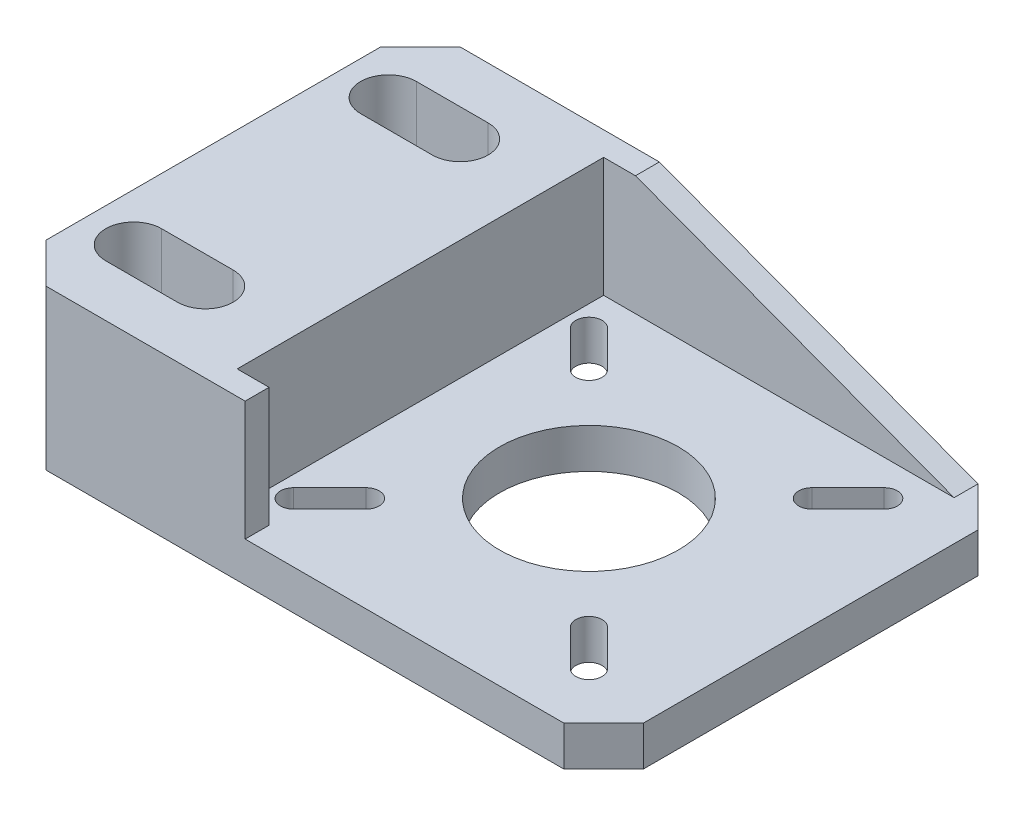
ISO-10303-21;
HEADER;
FILE_DESCRIPTION(('STEP AP214'),'2;1');
FILE_NAME('part.step','',(''),(''),'','','');
FILE_SCHEMA(('AUTOMOTIVE_DESIGN { 1 0 10303 214 1 1 1 1 }'));
ENDSEC;
DATA;
#1=APPLICATION_CONTEXT('core data for automotive mechanical design processes');
#2=APPLICATION_PROTOCOL_DEFINITION('international standard','automotive_design',2000,#1);
#3=PRODUCT_CONTEXT('',#1,'mechanical');
#4=PRODUCT('Part','Part','',(#3));
#5=PRODUCT_RELATED_PRODUCT_CATEGORY('part','',(#4));
#6=PRODUCT_DEFINITION_FORMATION('','',#4);
#7=PRODUCT_DEFINITION_CONTEXT('part definition',#1,'design');
#8=PRODUCT_DEFINITION('design','',#6,#7);
#9=PRODUCT_DEFINITION_SHAPE('','',#8);
#10=(LENGTH_UNIT() NAMED_UNIT(*) SI_UNIT(.MILLI.,.METRE.));
#11=(NAMED_UNIT(*) PLANE_ANGLE_UNIT() SI_UNIT($,.RADIAN.));
#12=(NAMED_UNIT(*) SI_UNIT($,.STERADIAN.) SOLID_ANGLE_UNIT());
#13=UNCERTAINTY_MEASURE_WITH_UNIT(LENGTH_MEASURE(1.E-05),#10,'distance_accuracy_value','');
#14=(GEOMETRIC_REPRESENTATION_CONTEXT(3) GLOBAL_UNCERTAINTY_ASSIGNED_CONTEXT((#13)) GLOBAL_UNIT_ASSIGNED_CONTEXT((#10,
#11,#12)) REPRESENTATION_CONTEXT('',''));
#15=CARTESIAN_POINT('',(0.,0.,0.));
#16=DIRECTION('',(0.,0.,1.));
#17=DIRECTION('',(1.,0.,0.));
#18=AXIS2_PLACEMENT_3D('',#15,#16,#17);
#19=CARTESIAN_POINT('',(502.609898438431,-41.1735855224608,95.0226086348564));
#20=DIRECTION('',(0.,0.,1.));
#21=DIRECTION('',(1.,0.,0.));
#22=AXIS2_PLACEMENT_3D('',#19,#20,#21);
#23=PLANE('',#22);
#24=DIRECTION('',(1.,0.,0.));
#25=VECTOR('',#24,1.);
#26=CARTESIAN_POINT('',(0.,20.,95.0226086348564));
#27=LINE('',#26,#25);
#28=CARTESIAN_POINT('',(502.609898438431,20.,95.0226086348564));
#29=VERTEX_POINT('',#28);
#30=CARTESIAN_POINT('',(498.609898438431,20.,95.0226086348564));
#31=VERTEX_POINT('',#30);
#32=EDGE_CURVE('E435',#29,#31,#27,.F.);
#33=ORIENTED_EDGE('',*,*,#32,.F.);
#34=DIRECTION('',(0.,1.,0.));
#35=VECTOR('',#34,1.);
#36=CARTESIAN_POINT('',(502.609898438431,20.,95.0226086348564));
#37=LINE('',#36,#35);
#38=CARTESIAN_POINT('',(502.609898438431,5.,95.0226086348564));
#39=VERTEX_POINT('',#38);
#40=EDGE_CURVE('E444',#29,#39,#37,.F.);
#41=ORIENTED_EDGE('',*,*,#40,.T.);
#42=DIRECTION('',(1.,0.,0.));
#43=VECTOR('',#42,1.);
#44=CARTESIAN_POINT('',(0.,5.,95.0226086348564));
#45=LINE('',#44,#43);
#46=CARTESIAN_POINT('',(498.609898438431,5.,95.0226086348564));
#47=VERTEX_POINT('',#46);
#48=EDGE_CURVE('E406',#39,#47,#45,.F.);
#49=ORIENTED_EDGE('',*,*,#48,.T.);
#50=DIRECTION('',(0.,1.,0.));
#51=VECTOR('',#50,1.);
#52=CARTESIAN_POINT('',(498.609898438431,-41.1735855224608,95.0226086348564));
#53=LINE('',#52,#51);
#54=EDGE_CURVE('E455',#47,#31,#53,.T.);
#55=ORIENTED_EDGE('',*,*,#54,.T.);
#56=EDGE_LOOP('',(#33,#41,#49,#55));
#57=FACE_BOUND('',#56,.T.);
#58=ADVANCED_FACE('F17',(#57),#23,.F.);
#59=CARTESIAN_POINT('',(498.609898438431,-41.1735855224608,49.0226086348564));
#60=DIRECTION('',(-1.,0.,0.));
#61=DIRECTION('',(0.,0.,1.));
#62=AXIS2_PLACEMENT_3D('',#59,#60,#61);
#63=PLANE('',#62);
#64=DIRECTION('',(0.,0.,1.));
#65=VECTOR('',#64,1.);
#66=CARTESIAN_POINT('',(498.609898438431,20.,0.));
#67=LINE('',#66,#65);
#68=CARTESIAN_POINT('',(498.609898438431,20.,49.0226086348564));
#69=VERTEX_POINT('',#68);
#70=EDGE_CURVE('E432',#31,#69,#67,.F.);
#71=ORIENTED_EDGE('',*,*,#70,.F.);
#72=ORIENTED_EDGE('',*,*,#54,.F.);
#73=DIRECTION('',(0.,0.,-1.));
#74=VECTOR('',#73,1.);
#75=CARTESIAN_POINT('',(498.609898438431,5.,0.));
#76=LINE('',#75,#74);
#77=CARTESIAN_POINT('',(498.609898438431,5.,49.0226086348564));
#78=VERTEX_POINT('',#77);
#79=EDGE_CURVE('E403',#47,#78,#76,.T.);
#80=ORIENTED_EDGE('',*,*,#79,.T.);
#81=DIRECTION('',(0.,1.,0.));
#82=VECTOR('',#81,1.);
#83=CARTESIAN_POINT('',(498.609898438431,0.,49.0226086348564));
#84=LINE('',#83,#82);
#85=EDGE_CURVE('E447',#78,#69,#84,.T.);
#86=ORIENTED_EDGE('',*,*,#85,.T.);
#87=EDGE_LOOP('',(#71,#72,#80,#86));
#88=FACE_BOUND('',#87,.T.);
#89=ADVANCED_FACE('F664',(#88),#63,.F.);
#90=CARTESIAN_POINT('',(0.,0.,49.0226086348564));
#91=DIRECTION('',(0.,0.,-1.));
#92=DIRECTION('',(-1.,0.,0.));
#93=AXIS2_PLACEMENT_3D('',#90,#91,#92);
#94=PLANE('',#93);
#95=DIRECTION('',(-0.936329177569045,0.351123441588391,0.));
#96=VECTOR('',#95,1.);
#97=CARTESIAN_POINT('',(542.609898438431,5.,49.0226086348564));
#98=LINE('',#97,#96);
#99=CARTESIAN_POINT('',(502.609898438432,20.,49.0226086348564));
#100=VERTEX_POINT('',#99);
#101=CARTESIAN_POINT('',(542.609898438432,4.99999999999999,49.0226086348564));
#102=VERTEX_POINT('',#101);
#103=EDGE_CURVE('E415',#100,#102,#98,.F.);
#104=ORIENTED_EDGE('',*,*,#103,.F.);
#105=DIRECTION('',(1.,0.,0.));
#106=VECTOR('',#105,1.);
#107=CARTESIAN_POINT('',(0.,20.,49.0226086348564));
#108=LINE('',#107,#106);
#109=EDGE_CURVE('E441',#69,#100,#108,.T.);
#110=ORIENTED_EDGE('',*,*,#109,.F.);
#111=ORIENTED_EDGE('',*,*,#85,.F.);
#112=DIRECTION('',(1.,0.,0.));
#113=VECTOR('',#112,1.);
#114=CARTESIAN_POINT('',(0.,5.,49.0226086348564));
#115=LINE('',#114,#113);
#116=EDGE_CURVE('E399',#78,#102,#115,.T.);
#117=ORIENTED_EDGE('',*,*,#116,.T.);
#118=EDGE_LOOP('',(#104,#110,#111,#117));
#119=FACE_BOUND('',#118,.T.);
#120=ADVANCED_FACE('F661',(#119),#94,.F.);
#121=CARTESIAN_POINT('',(502.609898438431,20.,46.0226086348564));
#122=DIRECTION('',(-1.,0.,0.));
#123=DIRECTION('',(0.,0.,1.));
#124=AXIS2_PLACEMENT_3D('',#121,#122,#123);
#125=PLANE('',#124);
#126=ORIENTED_EDGE('',*,*,#40,.F.);
#127=DIRECTION('',(0.,0.,1.));
#128=VECTOR('',#127,1.);
#129=CARTESIAN_POINT('',(502.609898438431,20.,0.));
#130=LINE('',#129,#128);
#131=CARTESIAN_POINT('',(502.609898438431,20.,98.0226086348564));
#132=VERTEX_POINT('',#131);
#133=EDGE_CURVE('E438',#132,#29,#130,.F.);
#134=ORIENTED_EDGE('',*,*,#133,.F.);
#135=DIRECTION('',(0.,1.,0.));
#136=VECTOR('',#135,1.);
#137=CARTESIAN_POINT('',(502.609898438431,5.,98.0226086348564));
#138=LINE('',#137,#136);
#139=CARTESIAN_POINT('',(502.609898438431,5.,98.0226086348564));
#140=VERTEX_POINT('',#139);
#141=EDGE_CURVE('E372',#132,#140,#138,.F.);
#142=ORIENTED_EDGE('',*,*,#141,.T.);
#143=DIRECTION('',(0.,0.,-1.));
#144=VECTOR('',#143,1.);
#145=CARTESIAN_POINT('',(502.609898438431,5.,0.));
#146=LINE('',#145,#144);
#147=EDGE_CURVE('E409',#140,#39,#146,.T.);
#148=ORIENTED_EDGE('',*,*,#147,.T.);
#149=EDGE_LOOP('',(#126,#134,#142,#148));
#150=FACE_BOUND('',#149,.T.);
#151=ADVANCED_FACE('F657',(#150),#125,.F.);
#152=CARTESIAN_POINT('',(0.,20.,0.));
#153=DIRECTION('',(0.,1.,0.));
#154=DIRECTION('',(0.,0.,1.));
#155=AXIS2_PLACEMENT_3D('',#152,#153,#154);
#156=PLANE('',#155);
#157=DIRECTION('',(1.,0.,0.));
#158=VECTOR('',#157,1.);
#159=CARTESIAN_POINT('',(487.609898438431,20.,59.5226086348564));
#160=LINE('',#159,#158);
#161=CARTESIAN_POINT('',(487.609898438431,20.,59.5226086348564));
#162=VERTEX_POINT('',#161);
#163=CARTESIAN_POINT('',(478.609898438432,20.,59.5226086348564));
#164=VERTEX_POINT('',#163);
#165=EDGE_CURVE('E383',#162,#164,#160,.F.);
#166=ORIENTED_EDGE('',*,*,#165,.T.);
#167=CARTESIAN_POINT('',(478.609898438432,20.,56.0226086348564));
#168=DIRECTION('',(0.,-1.,0.));
#169=DIRECTION('',(0.,0.,-1.));
#170=AXIS2_PLACEMENT_3D('',#167,#168,#169);
#171=CIRCLE('',#170,3.50000000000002);
#172=CARTESIAN_POINT('',(478.609898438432,20.,52.5226086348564));
#173=VERTEX_POINT('',#172);
#174=EDGE_CURVE('E386',#164,#173,#171,.T.);
#175=ORIENTED_EDGE('',*,*,#174,.T.);
#176=DIRECTION('',(-1.,0.,0.));
#177=VECTOR('',#176,1.);
#178=CARTESIAN_POINT('',(487.609898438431,20.,52.5226086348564));
#179=LINE('',#178,#177);
#180=CARTESIAN_POINT('',(487.609898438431,20.,52.5226086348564));
#181=VERTEX_POINT('',#180);
#182=EDGE_CURVE('E448',#173,#181,#179,.F.);
#183=ORIENTED_EDGE('',*,*,#182,.T.);
#184=CARTESIAN_POINT('',(487.609898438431,20.,56.0226086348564));
#185=DIRECTION('',(0.,-1.,0.));
#186=DIRECTION('',(0.,0.,-1.));
#187=AXIS2_PLACEMENT_3D('',#184,#185,#186);
#188=CIRCLE('',#187,3.5);
#189=EDGE_CURVE('E375',#181,#162,#188,.T.);
#190=ORIENTED_EDGE('',*,*,#189,.T.);
#191=EDGE_LOOP('',(#166,#175,#183,#190));
#192=FACE_BOUND('',#191,.T.);
#193=DIRECTION('',(1.,0.,0.));
#194=VECTOR('',#193,1.);
#195=CARTESIAN_POINT('',(487.609898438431,20.,91.5226086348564));
#196=LINE('',#195,#194);
#197=CARTESIAN_POINT('',(487.609898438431,20.,91.5226086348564));
#198=VERTEX_POINT('',#197);
#199=CARTESIAN_POINT('',(478.609898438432,20.,91.5226086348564));
#200=VERTEX_POINT('',#199);
#201=EDGE_CURVE('E395',#198,#200,#196,.F.);
#202=ORIENTED_EDGE('',*,*,#201,.T.);
#203=CARTESIAN_POINT('',(478.609898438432,20.,88.0226086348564));
#204=DIRECTION('',(0.,-1.,0.));
#205=DIRECTION('',(0.,0.,-1.));
#206=AXIS2_PLACEMENT_3D('',#203,#204,#205);
#207=CIRCLE('',#206,3.50000000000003);
#208=CARTESIAN_POINT('',(478.609898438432,20.,84.5226086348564));
#209=VERTEX_POINT('',#208);
#210=EDGE_CURVE('E20',#200,#209,#207,.T.);
#211=ORIENTED_EDGE('',*,*,#210,.T.);
#212=DIRECTION('',(-1.,0.,0.));
#213=VECTOR('',#212,1.);
#214=CARTESIAN_POINT('',(487.609898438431,20.,84.5226086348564));
#215=LINE('',#214,#213);
#216=CARTESIAN_POINT('',(487.609898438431,20.,84.5226086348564));
#217=VERTEX_POINT('',#216);
#218=EDGE_CURVE('E402',#209,#217,#215,.F.);
#219=ORIENTED_EDGE('',*,*,#218,.T.);
#220=CARTESIAN_POINT('',(487.609898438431,20.,88.0226086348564));
#221=DIRECTION('',(0.,-1.,0.));
#222=DIRECTION('',(0.,0.,-1.));
#223=AXIS2_PLACEMENT_3D('',#220,#221,#222);
#224=CIRCLE('',#223,3.5);
#225=EDGE_CURVE('E393',#217,#198,#224,.T.);
#226=ORIENTED_EDGE('',*,*,#225,.T.);
#227=EDGE_LOOP('',(#202,#211,#219,#226));
#228=FACE_BOUND('',#227,.T.);
#229=ORIENTED_EDGE('',*,*,#32,.T.);
#230=ORIENTED_EDGE('',*,*,#70,.T.);
#231=ORIENTED_EDGE('',*,*,#109,.T.);
#232=DIRECTION('',(0.,0.,1.));
#233=VECTOR('',#232,1.);
#234=CARTESIAN_POINT('',(502.609898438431,20.,49.0226086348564));
#235=LINE('',#234,#233);
#236=CARTESIAN_POINT('',(502.609898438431,20.,46.0226086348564));
#237=VERTEX_POINT('',#236);
#238=EDGE_CURVE('E429',#237,#100,#235,.T.);
#239=ORIENTED_EDGE('',*,*,#238,.F.);
#240=DIRECTION('',(1.,0.,0.));
#241=VECTOR('',#240,1.);
#242=CARTESIAN_POINT('',(547.609898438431,20.,46.0226086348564));
#243=LINE('',#242,#241);
#244=CARTESIAN_POINT('',(477.609898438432,20.,46.0226086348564));
#245=VERTEX_POINT('',#244);
#246=EDGE_CURVE('E345',#237,#245,#243,.F.);
#247=ORIENTED_EDGE('',*,*,#246,.T.);
#248=DIRECTION('',(0.707106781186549,0.,-0.707106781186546));
#249=VECTOR('',#248,1.);
#250=CARTESIAN_POINT('',(472.609898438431,20.,51.0226086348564));
#251=LINE('',#250,#249);
#252=CARTESIAN_POINT('',(472.609898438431,20.,51.0226086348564));
#253=VERTEX_POINT('',#252);
#254=EDGE_CURVE('E348',#245,#253,#251,.F.);
#255=ORIENTED_EDGE('',*,*,#254,.T.);
#256=DIRECTION('',(0.,0.,-1.));
#257=VECTOR('',#256,1.);
#258=CARTESIAN_POINT('',(472.609898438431,20.,46.0226086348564));
#259=LINE('',#258,#257);
#260=CARTESIAN_POINT('',(472.609898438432,20.,93.0226086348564));
#261=VERTEX_POINT('',#260);
#262=EDGE_CURVE('E357',#253,#261,#259,.F.);
#263=ORIENTED_EDGE('',*,*,#262,.T.);
#264=DIRECTION('',(-0.707106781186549,0.,-0.707106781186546));
#265=VECTOR('',#264,1.);
#266=CARTESIAN_POINT('',(477.609898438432,20.,98.0226086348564));
#267=LINE('',#266,#265);
#268=CARTESIAN_POINT('',(477.609898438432,20.,98.0226086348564));
#269=VERTEX_POINT('',#268);
#270=EDGE_CURVE('E360',#261,#269,#267,.F.);
#271=ORIENTED_EDGE('',*,*,#270,.T.);
#272=DIRECTION('',(-1.,0.,0.));
#273=VECTOR('',#272,1.);
#274=CARTESIAN_POINT('',(547.609898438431,20.,98.0226086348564));
#275=LINE('',#274,#273);
#276=EDGE_CURVE('E366',#269,#132,#275,.F.);
#277=ORIENTED_EDGE('',*,*,#276,.T.);
#278=ORIENTED_EDGE('',*,*,#133,.T.);
#279=EDGE_LOOP('',(#229,#230,#231,#239,#247,#255,#263,#271,#277,#278));
#280=FACE_BOUND('',#279,.T.);
#281=ADVANCED_FACE('F500',(#192,#228,#280),#156,.T.);
#282=CARTESIAN_POINT('',(542.609898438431,5.,49.0226086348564));
#283=DIRECTION('',(0.351123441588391,0.936329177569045,0.));
#284=DIRECTION('',(-0.936329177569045,0.351123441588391,0.));
#285=AXIS2_PLACEMENT_3D('',#282,#283,#284);
#286=PLANE('',#285);
#287=ORIENTED_EDGE('',*,*,#103,.T.);
#288=DIRECTION('',(0.,0.,-1.));
#289=VECTOR('',#288,1.);
#290=CARTESIAN_POINT('',(542.609898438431,5.,0.));
#291=LINE('',#290,#289);
#292=CARTESIAN_POINT('',(542.609898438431,5.,46.0226086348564));
#293=VERTEX_POINT('',#292);
#294=EDGE_CURVE('E412',#102,#293,#291,.T.);
#295=ORIENTED_EDGE('',*,*,#294,.T.);
#296=DIRECTION('',(-0.936329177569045,0.351123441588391,0.));
#297=VECTOR('',#296,1.);
#298=CARTESIAN_POINT('',(542.609898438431,5.,46.0226086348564));
#299=LINE('',#298,#297);
#300=EDGE_CURVE('E339',#293,#237,#299,.T.);
#301=ORIENTED_EDGE('',*,*,#300,.T.);
#302=ORIENTED_EDGE('',*,*,#238,.T.);
#303=EDGE_LOOP('',(#287,#295,#301,#302));
#304=FACE_BOUND('',#303,.T.);
#305=ADVANCED_FACE('F650',(#304),#286,.T.);
#306=CARTESIAN_POINT('',(0.,5.,0.));
#307=DIRECTION('',(0.,-1.,0.));
#308=DIRECTION('',(0.,0.,-1.));
#309=AXIS2_PLACEMENT_3D('',#306,#307,#308);
#310=PLANE('',#309);
#311=DIRECTION('',(0.707106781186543,0.,-0.707106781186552));
#312=VECTOR('',#311,1.);
#313=CARTESIAN_POINT('',(500.067165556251,5.,89.3914163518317));
#314=LINE('',#313,#312);
#315=CARTESIAN_POINT('',(504.611321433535,5.,84.8472604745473));
#316=VERTEX_POINT('',#315);
#317=CARTESIAN_POINT('',(500.067165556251,5.,89.3914163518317));
#318=VERTEX_POINT('',#317);
#319=EDGE_CURVE('E316',#316,#318,#314,.F.);
#320=ORIENTED_EDGE('',*,*,#319,.F.);
#321=CARTESIAN_POINT('',(505.778047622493,5.,86.013986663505));
#322=DIRECTION('',(0.,-1.,0.));
#323=DIRECTION('',(0.,0.,-1.));
#324=AXIS2_PLACEMENT_3D('',#321,#322,#323);
#325=CIRCLE('',#324,1.64999999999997);
#326=CARTESIAN_POINT('',(506.944773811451,5.,87.1807128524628));
#327=VERTEX_POINT('',#326);
#328=EDGE_CURVE('E305',#316,#327,#325,.T.);
#329=ORIENTED_EDGE('',*,*,#328,.T.);
#330=DIRECTION('',(-0.707106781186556,0.,0.707106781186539));
#331=VECTOR('',#330,1.);
#332=CARTESIAN_POINT('',(502.400617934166,5.,91.7248687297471));
#333=LINE('',#332,#331);
#334=CARTESIAN_POINT('',(502.400617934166,5.,91.7248687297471));
#335=VERTEX_POINT('',#334);
#336=EDGE_CURVE('E306',#335,#327,#333,.F.);
#337=ORIENTED_EDGE('',*,*,#336,.F.);
#338=CARTESIAN_POINT('',(501.233891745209,5.,90.5581425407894));
#339=DIRECTION('',(0.,-1.,0.));
#340=DIRECTION('',(0.,0.,-1.));
#341=AXIS2_PLACEMENT_3D('',#338,#339,#340);
#342=CIRCLE('',#341,1.6499999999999);
#343=EDGE_CURVE('E312',#335,#318,#342,.T.);
#344=ORIENTED_EDGE('',*,*,#343,.T.);
#345=EDGE_LOOP('',(#320,#329,#337,#344));
#346=FACE_BOUND('',#345,.T.);
#347=DIRECTION('',(-0.707106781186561,0.,-0.707106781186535));
#348=VECTOR('',#347,1.);
#349=CARTESIAN_POINT('',(537.138233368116,5.,91.7248687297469));
#350=LINE('',#349,#348);
#351=CARTESIAN_POINT('',(532.594077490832,5.,87.1807128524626));
#352=VERTEX_POINT('',#351);
#353=CARTESIAN_POINT('',(537.138233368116,5.,91.7248687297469));
#354=VERTEX_POINT('',#353);
#355=EDGE_CURVE('E295',#352,#354,#350,.F.);
#356=ORIENTED_EDGE('',*,*,#355,.F.);
#357=CARTESIAN_POINT('',(533.76080367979,5.,86.0139866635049));
#358=DIRECTION('',(0.,-1.,0.));
#359=DIRECTION('',(0.,0.,-1.));
#360=AXIS2_PLACEMENT_3D('',#357,#358,#359);
#361=CIRCLE('',#360,1.64999999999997);
#362=CARTESIAN_POINT('',(534.927529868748,5.,84.8472604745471));
#363=VERTEX_POINT('',#362);
#364=EDGE_CURVE('E283',#352,#363,#361,.T.);
#365=ORIENTED_EDGE('',*,*,#364,.T.);
#366=DIRECTION('',(0.707106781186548,0.,0.707106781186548));
#367=VECTOR('',#366,1.);
#368=CARTESIAN_POINT('',(539.471685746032,5.,89.3914163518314));
#369=LINE('',#368,#367);
#370=CARTESIAN_POINT('',(539.471685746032,5.,89.3914163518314));
#371=VERTEX_POINT('',#370);
#372=EDGE_CURVE('E288',#371,#363,#369,.F.);
#373=ORIENTED_EDGE('',*,*,#372,.F.);
#374=CARTESIAN_POINT('',(538.304959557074,5.,90.5581425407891));
#375=DIRECTION('',(0.,-1.,0.));
#376=DIRECTION('',(0.,0.,-1.));
#377=AXIS2_PLACEMENT_3D('',#374,#375,#376);
#378=CIRCLE('',#377,1.64999999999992);
#379=EDGE_CURVE('E293',#371,#354,#378,.T.);
#380=ORIENTED_EDGE('',*,*,#379,.T.);
#381=EDGE_LOOP('',(#356,#365,#373,#380));
#382=FACE_BOUND('',#381,.T.);
#383=CARTESIAN_POINT('',(519.769425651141,5.,72.0226086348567));
#384=DIRECTION('',(0.,-1.,0.));
#385=DIRECTION('',(0.,0.,-1.));
#386=AXIS2_PLACEMENT_3D('',#383,#384,#385);
#387=CIRCLE('',#386,11.2266785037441);
#388=CARTESIAN_POINT('',(519.769425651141,5.,60.7959301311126));
#389=VERTEX_POINT('',#388);
#390=EDGE_CURVE('E317',#389,#389,#387,.T.);
#391=ORIENTED_EDGE('',*,*,#390,.T.);
#392=EDGE_LOOP('',(#391));
#393=FACE_BOUND('',#392,.T.);
#394=DIRECTION('',(-0.707106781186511,0.,0.707106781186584));
#395=VECTOR('',#394,1.);
#396=CARTESIAN_POINT('',(539.471685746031,5.,54.6538009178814));
#397=LINE('',#396,#395);
#398=CARTESIAN_POINT('',(534.927529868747,5.,59.1979567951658));
#399=VERTEX_POINT('',#398);
#400=CARTESIAN_POINT('',(539.471685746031,5.,54.6538009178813));
#401=VERTEX_POINT('',#400);
#402=EDGE_CURVE('E302',#399,#401,#397,.F.);
#403=ORIENTED_EDGE('',*,*,#402,.F.);
#404=CARTESIAN_POINT('',(533.760803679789,5.,58.0312306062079));
#405=DIRECTION('',(0.,-1.,0.));
#406=DIRECTION('',(0.,0.,-1.));
#407=AXIS2_PLACEMENT_3D('',#404,#405,#406);
#408=CIRCLE('',#407,1.65000000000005);
#409=CARTESIAN_POINT('',(532.594077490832,5.,56.8645044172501));
#410=VERTEX_POINT('',#409);
#411=EDGE_CURVE('E296',#399,#410,#408,.T.);
#412=ORIENTED_EDGE('',*,*,#411,.T.);
#413=DIRECTION('',(0.707106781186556,0.,-0.707106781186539));
#414=VECTOR('',#413,1.);
#415=CARTESIAN_POINT('',(537.138233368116,5.,52.3203485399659));
#416=LINE('',#415,#414);
#417=CARTESIAN_POINT('',(537.138233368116,5.,52.3203485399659));
#418=VERTEX_POINT('',#417);
#419=EDGE_CURVE('E203',#418,#410,#416,.F.);
#420=ORIENTED_EDGE('',*,*,#419,.F.);
#421=CARTESIAN_POINT('',(538.304959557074,5.,53.4870747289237));
#422=DIRECTION('',(0.,-1.,0.));
#423=DIRECTION('',(0.,0.,-1.));
#424=AXIS2_PLACEMENT_3D('',#421,#422,#423);
#425=CIRCLE('',#424,1.64999999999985);
#426=EDGE_CURVE('E199',#418,#401,#425,.T.);
#427=ORIENTED_EDGE('',*,*,#426,.T.);
#428=EDGE_LOOP('',(#403,#412,#420,#427));
#429=FACE_BOUND('',#428,.T.);
#430=DIRECTION('',(-0.707106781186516,0.,-0.707106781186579));
#431=VECTOR('',#430,1.);
#432=CARTESIAN_POINT('',(500.067165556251,5.,54.6538009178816));
#433=LINE('',#432,#431);
#434=CARTESIAN_POINT('',(500.067165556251,5.,54.6538009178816));
#435=VERTEX_POINT('',#434);
#436=CARTESIAN_POINT('',(504.611321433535,5.,59.1979567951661));
#437=VERTEX_POINT('',#436);
#438=EDGE_CURVE('E271',#435,#437,#433,.F.);
#439=ORIENTED_EDGE('',*,*,#438,.F.);
#440=CARTESIAN_POINT('',(501.233891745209,5.,53.4870747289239));
#441=DIRECTION('',(0.,-1.,0.));
#442=DIRECTION('',(0.,0.,-1.));
#443=AXIS2_PLACEMENT_3D('',#440,#441,#442);
#444=CIRCLE('',#443,1.64999999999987);
#445=CARTESIAN_POINT('',(502.400617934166,5.,52.3203485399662));
#446=VERTEX_POINT('',#445);
#447=EDGE_CURVE('E275',#435,#446,#444,.T.);
#448=ORIENTED_EDGE('',*,*,#447,.T.);
#449=DIRECTION('',(0.707106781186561,0.,0.707106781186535));
#450=VECTOR('',#449,1.);
#451=CARTESIAN_POINT('',(502.400617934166,5.,52.3203485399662));
#452=LINE('',#451,#450);
#453=CARTESIAN_POINT('',(506.944773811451,5.,56.8645044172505));
#454=VERTEX_POINT('',#453);
#455=EDGE_CURVE('E279',#454,#446,#452,.F.);
#456=ORIENTED_EDGE('',*,*,#455,.F.);
#457=CARTESIAN_POINT('',(505.778047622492,5.,58.0312306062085));
#458=DIRECTION('',(0.,-1.,0.));
#459=DIRECTION('',(0.,0.,-1.));
#460=AXIS2_PLACEMENT_3D('',#457,#458,#459);
#461=CIRCLE('',#460,1.65000000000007);
#462=EDGE_CURVE('E267',#454,#437,#461,.T.);
#463=ORIENTED_EDGE('',*,*,#462,.T.);
#464=EDGE_LOOP('',(#439,#448,#456,#463));
#465=FACE_BOUND('',#464,.T.);
#466=ORIENTED_EDGE('',*,*,#79,.F.);
#467=ORIENTED_EDGE('',*,*,#48,.F.);
#468=ORIENTED_EDGE('',*,*,#147,.F.);
#469=DIRECTION('',(-1.,0.,0.));
#470=VECTOR('',#469,1.);
#471=CARTESIAN_POINT('',(547.609898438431,5.,98.0226086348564));
#472=LINE('',#471,#470);
#473=CARTESIAN_POINT('',(542.609898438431,5.,98.0226086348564));
#474=VERTEX_POINT('',#473);
#475=EDGE_CURVE('E369',#140,#474,#472,.F.);
#476=ORIENTED_EDGE('',*,*,#475,.T.);
#477=DIRECTION('',(-0.707106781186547,0.,0.707106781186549));
#478=VECTOR('',#477,1.);
#479=CARTESIAN_POINT('',(547.609898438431,5.,93.0226086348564));
#480=LINE('',#479,#478);
#481=CARTESIAN_POINT('',(547.609898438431,5.,93.0226086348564));
#482=VERTEX_POINT('',#481);
#483=EDGE_CURVE('E318',#474,#482,#480,.F.);
#484=ORIENTED_EDGE('',*,*,#483,.T.);
#485=DIRECTION('',(0.,0.,1.));
#486=VECTOR('',#485,1.);
#487=CARTESIAN_POINT('',(547.609898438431,5.,46.0226086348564));
#488=LINE('',#487,#486);
#489=CARTESIAN_POINT('',(547.609898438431,5.,51.0226086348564));
#490=VERTEX_POINT('',#489);
#491=EDGE_CURVE('E327',#482,#490,#488,.F.);
#492=ORIENTED_EDGE('',*,*,#491,.T.);
#493=DIRECTION('',(0.707106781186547,0.,0.707106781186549));
#494=VECTOR('',#493,1.);
#495=CARTESIAN_POINT('',(542.609898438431,5.,46.0226086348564));
#496=LINE('',#495,#494);
#497=EDGE_CURVE('E333',#490,#293,#496,.F.);
#498=ORIENTED_EDGE('',*,*,#497,.T.);
#499=ORIENTED_EDGE('',*,*,#294,.F.);
#500=ORIENTED_EDGE('',*,*,#116,.F.);
#501=EDGE_LOOP('',(#466,#467,#468,#476,#484,#492,#498,#499,#500));
#502=FACE_BOUND('',#501,.T.);
#503=ADVANCED_FACE('F647',(#346,#382,#393,#429,#465,#502),#310,.F.);
#504=CARTESIAN_POINT('',(487.609898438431,20.,84.5226086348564));
#505=DIRECTION('',(0.,0.,-1.));
#506=DIRECTION('',(-1.,0.,0.));
#507=AXIS2_PLACEMENT_3D('',#504,#505,#506);
#508=PLANE('',#507);
#509=DIRECTION('',(0.,-1.,0.));
#510=VECTOR('',#509,1.);
#511=CARTESIAN_POINT('',(487.609898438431,5.,84.5226086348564));
#512=LINE('',#511,#510);
#513=CARTESIAN_POINT('',(487.609898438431,0.,84.5226086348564));
#514=VERTEX_POINT('',#513);
#515=EDGE_CURVE('E389',#514,#217,#512,.F.);
#516=ORIENTED_EDGE('',*,*,#515,.T.);
#517=ORIENTED_EDGE('',*,*,#218,.F.);
#518=DIRECTION('',(0.,-1.,0.));
#519=VECTOR('',#518,1.);
#520=CARTESIAN_POINT('',(478.609898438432,20.,84.5226086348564));
#521=LINE('',#520,#519);
#522=CARTESIAN_POINT('',(478.609898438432,0.,84.5226086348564));
#523=VERTEX_POINT('',#522);
#524=EDGE_CURVE('E396',#209,#523,#521,.T.);
#525=ORIENTED_EDGE('',*,*,#524,.T.);
#526=DIRECTION('',(1.,0.,0.));
#527=VECTOR('',#526,1.);
#528=CARTESIAN_POINT('',(0.,0.,84.5226086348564));
#529=LINE('',#528,#527);
#530=EDGE_CURVE('E263',#514,#523,#529,.F.);
#531=ORIENTED_EDGE('',*,*,#530,.F.);
#532=EDGE_LOOP('',(#516,#517,#525,#531));
#533=FACE_BOUND('',#532,.T.);
#534=ADVANCED_FACE('F517',(#533),#508,.F.);
#535=CARTESIAN_POINT('',(478.609898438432,20.,88.0226086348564));
#536=DIRECTION('',(0.,-1.,0.));
#537=DIRECTION('',(0.,0.,-1.));
#538=AXIS2_PLACEMENT_3D('',#535,#536,#537);
#539=CYLINDRICAL_SURFACE('',#538,3.50000000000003);
#540=ORIENTED_EDGE('',*,*,#524,.F.);
#541=ORIENTED_EDGE('',*,*,#210,.F.);
#542=DIRECTION('',(0.,1.,0.));
#543=VECTOR('',#542,1.);
#544=CARTESIAN_POINT('',(478.609898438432,20.,91.5226086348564));
#545=LINE('',#544,#543);
#546=CARTESIAN_POINT('',(478.609898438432,0.,91.5226086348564));
#547=VERTEX_POINT('',#546);
#548=EDGE_CURVE('E390',#200,#547,#545,.F.);
#549=ORIENTED_EDGE('',*,*,#548,.T.);
#550=CARTESIAN_POINT('',(478.609898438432,0.,88.0226086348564));
#551=DIRECTION('',(0.,-1.,0.));
#552=DIRECTION('',(0.,0.,-1.));
#553=AXIS2_PLACEMENT_3D('',#550,#551,#552);
#554=CIRCLE('',#553,3.50000000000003);
#555=EDGE_CURVE('E262',#523,#547,#554,.F.);
#556=ORIENTED_EDGE('',*,*,#555,.F.);
#557=EDGE_LOOP('',(#540,#541,#549,#556));
#558=FACE_BOUND('',#557,.T.);
#559=ADVANCED_FACE('F515',(#558),#539,.F.);
#560=CARTESIAN_POINT('',(487.609898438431,20.,91.5226086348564));
#561=DIRECTION('',(0.,0.,1.));
#562=DIRECTION('',(1.,0.,0.));
#563=AXIS2_PLACEMENT_3D('',#560,#561,#562);
#564=PLANE('',#563);
#565=ORIENTED_EDGE('',*,*,#548,.F.);
#566=ORIENTED_EDGE('',*,*,#201,.F.);
#567=DIRECTION('',(0.,-1.,0.));
#568=VECTOR('',#567,1.);
#569=CARTESIAN_POINT('',(487.609898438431,5.,91.5226086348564));
#570=LINE('',#569,#568);
#571=CARTESIAN_POINT('',(487.609898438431,0.,91.5226086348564));
#572=VERTEX_POINT('',#571);
#573=EDGE_CURVE('E387',#198,#572,#570,.T.);
#574=ORIENTED_EDGE('',*,*,#573,.T.);
#575=DIRECTION('',(1.,0.,0.));
#576=VECTOR('',#575,1.);
#577=CARTESIAN_POINT('',(0.,0.,91.5226086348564));
#578=LINE('',#577,#576);
#579=EDGE_CURVE('E259',#547,#572,#578,.T.);
#580=ORIENTED_EDGE('',*,*,#579,.F.);
#581=EDGE_LOOP('',(#565,#566,#574,#580));
#582=FACE_BOUND('',#581,.T.);
#583=ADVANCED_FACE('F511',(#582),#564,.F.);
#584=CARTESIAN_POINT('',(487.609898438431,5.,88.0226086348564));
#585=DIRECTION('',(0.,-1.,0.));
#586=DIRECTION('',(0.,0.,-1.));
#587=AXIS2_PLACEMENT_3D('',#584,#585,#586);
#588=CYLINDRICAL_SURFACE('',#587,3.5);
#589=ORIENTED_EDGE('',*,*,#515,.F.);
#590=CARTESIAN_POINT('',(487.609898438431,0.,88.0226086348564));
#591=DIRECTION('',(0.,-1.,0.));
#592=DIRECTION('',(0.,0.,-1.));
#593=AXIS2_PLACEMENT_3D('',#590,#591,#592);
#594=CIRCLE('',#593,3.5);
#595=EDGE_CURVE('E258',#572,#514,#594,.F.);
#596=ORIENTED_EDGE('',*,*,#595,.F.);
#597=ORIENTED_EDGE('',*,*,#573,.F.);
#598=ORIENTED_EDGE('',*,*,#225,.F.);
#599=EDGE_LOOP('',(#589,#596,#597,#598));
#600=FACE_BOUND('',#599,.T.);
#601=ADVANCED_FACE('F507',(#600),#588,.F.);
#602=CARTESIAN_POINT('',(487.609898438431,20.,52.5226086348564));
#603=DIRECTION('',(0.,0.,-1.));
#604=DIRECTION('',(-1.,0.,0.));
#605=AXIS2_PLACEMENT_3D('',#602,#603,#604);
#606=PLANE('',#605);
#607=DIRECTION('',(0.,-1.,0.));
#608=VECTOR('',#607,1.);
#609=CARTESIAN_POINT('',(487.609898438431,5.,52.5226086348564));
#610=LINE('',#609,#608);
#611=CARTESIAN_POINT('',(487.609898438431,0.,52.5226086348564));
#612=VERTEX_POINT('',#611);
#613=EDGE_CURVE('E378',#612,#181,#610,.F.);
#614=ORIENTED_EDGE('',*,*,#613,.T.);
#615=ORIENTED_EDGE('',*,*,#182,.F.);
#616=DIRECTION('',(0.,-1.,0.));
#617=VECTOR('',#616,1.);
#618=CARTESIAN_POINT('',(478.609898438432,20.,52.5226086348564));
#619=LINE('',#618,#617);
#620=CARTESIAN_POINT('',(478.609898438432,0.,52.5226086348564));
#621=VERTEX_POINT('',#620);
#622=EDGE_CURVE('E384',#173,#621,#619,.T.);
#623=ORIENTED_EDGE('',*,*,#622,.T.);
#624=DIRECTION('',(1.,0.,0.));
#625=VECTOR('',#624,1.);
#626=CARTESIAN_POINT('',(0.,0.,52.5226086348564));
#627=LINE('',#626,#625);
#628=EDGE_CURVE('E255',#612,#621,#627,.F.);
#629=ORIENTED_EDGE('',*,*,#628,.F.);
#630=EDGE_LOOP('',(#614,#615,#623,#629));
#631=FACE_BOUND('',#630,.T.);
#632=ADVANCED_FACE('F634',(#631),#606,.F.);
#633=CARTESIAN_POINT('',(478.609898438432,20.,56.0226086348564));
#634=DIRECTION('',(0.,-1.,0.));
#635=DIRECTION('',(0.,0.,-1.));
#636=AXIS2_PLACEMENT_3D('',#633,#634,#635);
#637=CYLINDRICAL_SURFACE('',#636,3.50000000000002);
#638=ORIENTED_EDGE('',*,*,#622,.F.);
#639=ORIENTED_EDGE('',*,*,#174,.F.);
#640=DIRECTION('',(0.,1.,0.));
#641=VECTOR('',#640,1.);
#642=CARTESIAN_POINT('',(478.609898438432,20.,59.5226086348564));
#643=LINE('',#642,#641);
#644=CARTESIAN_POINT('',(478.609898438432,0.,59.5226086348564));
#645=VERTEX_POINT('',#644);
#646=EDGE_CURVE('E379',#164,#645,#643,.F.);
#647=ORIENTED_EDGE('',*,*,#646,.T.);
#648=CARTESIAN_POINT('',(478.609898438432,0.,56.0226086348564));
#649=DIRECTION('',(0.,-1.,0.));
#650=DIRECTION('',(0.,0.,-1.));
#651=AXIS2_PLACEMENT_3D('',#648,#649,#650);
#652=CIRCLE('',#651,3.50000000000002);
#653=EDGE_CURVE('E254',#621,#645,#652,.F.);
#654=ORIENTED_EDGE('',*,*,#653,.F.);
#655=EDGE_LOOP('',(#638,#639,#647,#654));
#656=FACE_BOUND('',#655,.T.);
#657=ADVANCED_FACE('F630',(#656),#637,.F.);
#658=CARTESIAN_POINT('',(487.609898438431,20.,59.5226086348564));
#659=DIRECTION('',(0.,0.,1.));
#660=DIRECTION('',(1.,0.,0.));
#661=AXIS2_PLACEMENT_3D('',#658,#659,#660);
#662=PLANE('',#661);
#663=ORIENTED_EDGE('',*,*,#646,.F.);
#664=ORIENTED_EDGE('',*,*,#165,.F.);
#665=DIRECTION('',(0.,-1.,0.));
#666=VECTOR('',#665,1.);
#667=CARTESIAN_POINT('',(487.609898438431,5.,59.5226086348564));
#668=LINE('',#667,#666);
#669=CARTESIAN_POINT('',(487.609898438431,0.,59.5226086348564));
#670=VERTEX_POINT('',#669);
#671=EDGE_CURVE('E376',#162,#670,#668,.T.);
#672=ORIENTED_EDGE('',*,*,#671,.T.);
#673=DIRECTION('',(1.,0.,0.));
#674=VECTOR('',#673,1.);
#675=CARTESIAN_POINT('',(0.,0.,59.5226086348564));
#676=LINE('',#675,#674);
#677=EDGE_CURVE('E251',#645,#670,#676,.T.);
#678=ORIENTED_EDGE('',*,*,#677,.F.);
#679=EDGE_LOOP('',(#663,#664,#672,#678));
#680=FACE_BOUND('',#679,.T.);
#681=ADVANCED_FACE('F626',(#680),#662,.F.);
#682=CARTESIAN_POINT('',(487.609898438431,5.,56.0226086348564));
#683=DIRECTION('',(0.,-1.,0.));
#684=DIRECTION('',(0.,0.,-1.));
#685=AXIS2_PLACEMENT_3D('',#682,#683,#684);
#686=CYLINDRICAL_SURFACE('',#685,3.5);
#687=ORIENTED_EDGE('',*,*,#613,.F.);
#688=CARTESIAN_POINT('',(487.609898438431,0.,56.0226086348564));
#689=DIRECTION('',(0.,-1.,0.));
#690=DIRECTION('',(0.,0.,-1.));
#691=AXIS2_PLACEMENT_3D('',#688,#689,#690);
#692=CIRCLE('',#691,3.5);
#693=EDGE_CURVE('E250',#670,#612,#692,.F.);
#694=ORIENTED_EDGE('',*,*,#693,.F.);
#695=ORIENTED_EDGE('',*,*,#671,.F.);
#696=ORIENTED_EDGE('',*,*,#189,.F.);
#697=EDGE_LOOP('',(#687,#694,#695,#696));
#698=FACE_BOUND('',#697,.T.);
#699=ADVANCED_FACE('F622',(#698),#686,.F.);
#700=CARTESIAN_POINT('',(547.609898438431,5.,98.0226086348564));
#701=DIRECTION('',(0.,0.,-1.));
#702=DIRECTION('',(-1.,0.,0.));
#703=AXIS2_PLACEMENT_3D('',#700,#701,#702);
#704=PLANE('',#703);
#705=DIRECTION('',(0.,1.,0.));
#706=VECTOR('',#705,1.);
#707=CARTESIAN_POINT('',(477.609898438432,5.,98.0226086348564));
#708=LINE('',#707,#706);
#709=CARTESIAN_POINT('',(477.609898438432,0.,98.0226086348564));
#710=VERTEX_POINT('',#709);
#711=EDGE_CURVE('E363',#269,#710,#708,.F.);
#712=ORIENTED_EDGE('',*,*,#711,.T.);
#713=DIRECTION('',(1.,0.,0.));
#714=VECTOR('',#713,1.);
#715=CARTESIAN_POINT('',(0.,0.,98.0226086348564));
#716=LINE('',#715,#714);
#717=CARTESIAN_POINT('',(542.609898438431,0.,98.0226086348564));
#718=VERTEX_POINT('',#717);
#719=EDGE_CURVE('E247',#718,#710,#716,.F.);
#720=ORIENTED_EDGE('',*,*,#719,.F.);
#721=DIRECTION('',(0.,1.,0.));
#722=VECTOR('',#721,1.);
#723=CARTESIAN_POINT('',(542.609898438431,5.,98.0226086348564));
#724=LINE('',#723,#722);
#725=EDGE_CURVE('E321',#718,#474,#724,.T.);
#726=ORIENTED_EDGE('',*,*,#725,.T.);
#727=ORIENTED_EDGE('',*,*,#475,.F.);
#728=ORIENTED_EDGE('',*,*,#141,.F.);
#729=ORIENTED_EDGE('',*,*,#276,.F.);
#730=EDGE_LOOP('',(#712,#720,#726,#727,#728,#729));
#731=FACE_BOUND('',#730,.T.);
#732=ADVANCED_FACE('F618',(#731),#704,.F.);
#733=CARTESIAN_POINT('',(477.609898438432,5.,98.0226086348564));
#734=DIRECTION('',(0.707106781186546,0.,-0.707106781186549));
#735=DIRECTION('',(-0.707106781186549,0.,-0.707106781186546));
#736=AXIS2_PLACEMENT_3D('',#733,#734,#735);
#737=PLANE('',#736);
#738=DIRECTION('',(0.,1.,0.));
#739=VECTOR('',#738,1.);
#740=CARTESIAN_POINT('',(472.609898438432,5.,93.0226086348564));
#741=LINE('',#740,#739);
#742=CARTESIAN_POINT('',(472.609898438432,0.,93.0226086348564));
#743=VERTEX_POINT('',#742);
#744=EDGE_CURVE('E354',#261,#743,#741,.F.);
#745=ORIENTED_EDGE('',*,*,#744,.T.);
#746=DIRECTION('',(-0.707106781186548,0.,-0.707106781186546));
#747=VECTOR('',#746,1.);
#748=CARTESIAN_POINT('',(477.609898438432,0.,98.0226086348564));
#749=LINE('',#748,#747);
#750=EDGE_CURVE('E244',#710,#743,#749,.T.);
#751=ORIENTED_EDGE('',*,*,#750,.F.);
#752=ORIENTED_EDGE('',*,*,#711,.F.);
#753=ORIENTED_EDGE('',*,*,#270,.F.);
#754=EDGE_LOOP('',(#745,#751,#752,#753));
#755=FACE_BOUND('',#754,.T.);
#756=ADVANCED_FACE('F614',(#755),#737,.F.);
#757=CARTESIAN_POINT('',(472.609898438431,5.,46.0226086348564));
#758=DIRECTION('',(1.,0.,0.));
#759=DIRECTION('',(0.,0.,-1.));
#760=AXIS2_PLACEMENT_3D('',#757,#758,#759);
#761=PLANE('',#760);
#762=ORIENTED_EDGE('',*,*,#744,.F.);
#763=ORIENTED_EDGE('',*,*,#262,.F.);
#764=DIRECTION('',(0.,1.,0.));
#765=VECTOR('',#764,1.);
#766=CARTESIAN_POINT('',(472.609898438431,5.,51.0226086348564));
#767=LINE('',#766,#765);
#768=CARTESIAN_POINT('',(472.609898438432,0.,51.0226086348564));
#769=VERTEX_POINT('',#768);
#770=EDGE_CURVE('E351',#253,#769,#767,.F.);
#771=ORIENTED_EDGE('',*,*,#770,.T.);
#772=DIRECTION('',(0.,0.,-1.));
#773=VECTOR('',#772,1.);
#774=CARTESIAN_POINT('',(472.609898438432,0.,0.));
#775=LINE('',#774,#773);
#776=EDGE_CURVE('E241',#743,#769,#775,.T.);
#777=ORIENTED_EDGE('',*,*,#776,.F.);
#778=EDGE_LOOP('',(#762,#763,#771,#777));
#779=FACE_BOUND('',#778,.T.);
#780=ADVANCED_FACE('F610',(#779),#761,.F.);
#781=CARTESIAN_POINT('',(472.609898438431,5.,51.0226086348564));
#782=DIRECTION('',(0.707106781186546,0.,0.707106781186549));
#783=DIRECTION('',(0.707106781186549,0.,-0.707106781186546));
#784=AXIS2_PLACEMENT_3D('',#781,#782,#783);
#785=PLANE('',#784);
#786=DIRECTION('',(0.,1.,0.));
#787=VECTOR('',#786,1.);
#788=CARTESIAN_POINT('',(477.609898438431,5.,46.0226086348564));
#789=LINE('',#788,#787);
#790=CARTESIAN_POINT('',(477.609898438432,0.,46.0226086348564));
#791=VERTEX_POINT('',#790);
#792=EDGE_CURVE('E342',#245,#791,#789,.F.);
#793=ORIENTED_EDGE('',*,*,#792,.T.);
#794=DIRECTION('',(0.707106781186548,0.,-0.707106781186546));
#795=VECTOR('',#794,1.);
#796=CARTESIAN_POINT('',(472.609898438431,0.,51.0226086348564));
#797=LINE('',#796,#795);
#798=EDGE_CURVE('E238',#769,#791,#797,.T.);
#799=ORIENTED_EDGE('',*,*,#798,.F.);
#800=ORIENTED_EDGE('',*,*,#770,.F.);
#801=ORIENTED_EDGE('',*,*,#254,.F.);
#802=EDGE_LOOP('',(#793,#799,#800,#801));
#803=FACE_BOUND('',#802,.T.);
#804=ADVANCED_FACE('F606',(#803),#785,.F.);
#805=CARTESIAN_POINT('',(547.609898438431,5.,46.0226086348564));
#806=DIRECTION('',(0.,0.,1.));
#807=DIRECTION('',(1.,0.,0.));
#808=AXIS2_PLACEMENT_3D('',#805,#806,#807);
#809=PLANE('',#808);
#810=DIRECTION('',(0.,1.,0.));
#811=VECTOR('',#810,1.);
#812=CARTESIAN_POINT('',(542.609898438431,5.,46.0226086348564));
#813=LINE('',#812,#811);
#814=CARTESIAN_POINT('',(542.609898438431,0.,46.0226086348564));
#815=VERTEX_POINT('',#814);
#816=EDGE_CURVE('E336',#293,#815,#813,.F.);
#817=ORIENTED_EDGE('',*,*,#816,.T.);
#818=DIRECTION('',(1.,0.,0.));
#819=VECTOR('',#818,1.);
#820=CARTESIAN_POINT('',(0.,0.,46.0226086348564));
#821=LINE('',#820,#819);
#822=EDGE_CURVE('E235',#791,#815,#821,.T.);
#823=ORIENTED_EDGE('',*,*,#822,.F.);
#824=ORIENTED_EDGE('',*,*,#792,.F.);
#825=ORIENTED_EDGE('',*,*,#246,.F.);
#826=ORIENTED_EDGE('',*,*,#300,.F.);
#827=EDGE_LOOP('',(#817,#823,#824,#825,#826));
#828=FACE_BOUND('',#827,.T.);
#829=ADVANCED_FACE('F602',(#828),#809,.F.);
#830=CARTESIAN_POINT('',(542.609898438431,5.,46.0226086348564));
#831=DIRECTION('',(-0.707106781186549,0.,0.707106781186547));
#832=DIRECTION('',(0.707106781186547,0.,0.707106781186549));
#833=AXIS2_PLACEMENT_3D('',#830,#831,#832);
#834=PLANE('',#833);
#835=DIRECTION('',(0.,1.,0.));
#836=VECTOR('',#835,1.);
#837=CARTESIAN_POINT('',(547.609898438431,5.,51.0226086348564));
#838=LINE('',#837,#836);
#839=CARTESIAN_POINT('',(547.609898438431,0.,51.0226086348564));
#840=VERTEX_POINT('',#839);
#841=EDGE_CURVE('E330',#490,#840,#838,.F.);
#842=ORIENTED_EDGE('',*,*,#841,.T.);
#843=DIRECTION('',(0.707106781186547,0.,0.707106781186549));
#844=VECTOR('',#843,1.);
#845=CARTESIAN_POINT('',(542.609898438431,0.,46.0226086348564));
#846=LINE('',#845,#844);
#847=EDGE_CURVE('E232',#815,#840,#846,.T.);
#848=ORIENTED_EDGE('',*,*,#847,.F.);
#849=ORIENTED_EDGE('',*,*,#816,.F.);
#850=ORIENTED_EDGE('',*,*,#497,.F.);
#851=EDGE_LOOP('',(#842,#848,#849,#850));
#852=FACE_BOUND('',#851,.T.);
#853=ADVANCED_FACE('F598',(#852),#834,.F.);
#854=CARTESIAN_POINT('',(547.609898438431,5.,46.0226086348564));
#855=DIRECTION('',(-1.,0.,0.));
#856=DIRECTION('',(0.,0.,1.));
#857=AXIS2_PLACEMENT_3D('',#854,#855,#856);
#858=PLANE('',#857);
#859=DIRECTION('',(0.,1.,0.));
#860=VECTOR('',#859,1.);
#861=CARTESIAN_POINT('',(547.609898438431,5.,93.0226086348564));
#862=LINE('',#861,#860);
#863=CARTESIAN_POINT('',(547.609898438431,0.,93.0226086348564));
#864=VERTEX_POINT('',#863);
#865=EDGE_CURVE('E324',#482,#864,#862,.F.);
#866=ORIENTED_EDGE('',*,*,#865,.T.);
#867=DIRECTION('',(0.,0.,-1.));
#868=VECTOR('',#867,1.);
#869=CARTESIAN_POINT('',(547.609898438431,0.,0.));
#870=LINE('',#869,#868);
#871=EDGE_CURVE('E229',#840,#864,#870,.F.);
#872=ORIENTED_EDGE('',*,*,#871,.F.);
#873=ORIENTED_EDGE('',*,*,#841,.F.);
#874=ORIENTED_EDGE('',*,*,#491,.F.);
#875=EDGE_LOOP('',(#866,#872,#873,#874));
#876=FACE_BOUND('',#875,.T.);
#877=ADVANCED_FACE('F594',(#876),#858,.F.);
#878=CARTESIAN_POINT('',(547.609898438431,5.,93.0226086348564));
#879=DIRECTION('',(-0.707106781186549,0.,-0.707106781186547));
#880=DIRECTION('',(-0.707106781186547,0.,0.707106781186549));
#881=AXIS2_PLACEMENT_3D('',#878,#879,#880);
#882=PLANE('',#881);
#883=ORIENTED_EDGE('',*,*,#725,.F.);
#884=DIRECTION('',(-0.707106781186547,0.,0.707106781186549));
#885=VECTOR('',#884,1.);
#886=CARTESIAN_POINT('',(547.609898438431,0.,93.0226086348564));
#887=LINE('',#886,#885);
#888=EDGE_CURVE('E226',#864,#718,#887,.T.);
#889=ORIENTED_EDGE('',*,*,#888,.F.);
#890=ORIENTED_EDGE('',*,*,#865,.F.);
#891=ORIENTED_EDGE('',*,*,#483,.F.);
#892=EDGE_LOOP('',(#883,#889,#890,#891));
#893=FACE_BOUND('',#892,.T.);
#894=ADVANCED_FACE('F590',(#893),#882,.F.);
#895=CARTESIAN_POINT('',(519.769425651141,5.,72.0226086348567));
#896=DIRECTION('',(0.,-1.,0.));
#897=DIRECTION('',(0.,0.,-1.));
#898=AXIS2_PLACEMENT_3D('',#895,#896,#897);
#899=CYLINDRICAL_SURFACE('',#898,11.2266785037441);
#900=ORIENTED_EDGE('',*,*,#390,.F.);
#901=EDGE_LOOP('',(#900));
#902=FACE_BOUND('',#901,.T.);
#903=CARTESIAN_POINT('',(519.769425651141,0.,72.0226086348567));
#904=DIRECTION('',(0.,-1.,0.));
#905=DIRECTION('',(0.,0.,-1.));
#906=AXIS2_PLACEMENT_3D('',#903,#904,#905);
#907=CIRCLE('',#906,11.2266785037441);
#908=CARTESIAN_POINT('',(519.769425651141,0.,60.7959301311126));
#909=VERTEX_POINT('',#908);
#910=EDGE_CURVE('E225',#909,#909,#907,.F.);
#911=ORIENTED_EDGE('',*,*,#910,.F.);
#912=EDGE_LOOP('',(#911));
#913=FACE_BOUND('',#912,.T.);
#914=ADVANCED_FACE('F586',(#902,#913),#899,.F.);
#915=CARTESIAN_POINT('',(500.067165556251,5.,89.3914163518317));
#916=DIRECTION('',(0.707106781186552,0.,0.707106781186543));
#917=DIRECTION('',(0.707106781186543,0.,-0.707106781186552));
#918=AXIS2_PLACEMENT_3D('',#915,#916,#917);
#919=PLANE('',#918);
#920=ORIENTED_EDGE('',*,*,#319,.T.);
#921=DIRECTION('',(0.,-1.,0.));
#922=VECTOR('',#921,1.);
#923=CARTESIAN_POINT('',(500.067165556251,5.,89.3914163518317));
#924=LINE('',#923,#922);
#925=CARTESIAN_POINT('',(500.067165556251,0.,89.3914163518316));
#926=VERTEX_POINT('',#925);
#927=EDGE_CURVE('E310',#318,#926,#924,.T.);
#928=ORIENTED_EDGE('',*,*,#927,.T.);
#929=DIRECTION('',(-0.707106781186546,0.,0.707106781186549));
#930=VECTOR('',#929,1.);
#931=CARTESIAN_POINT('',(504.611321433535,0.,84.8472604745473));
#932=LINE('',#931,#930);
#933=CARTESIAN_POINT('',(504.611321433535,0.,84.8472604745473));
#934=VERTEX_POINT('',#933);
#935=EDGE_CURVE('E222',#934,#926,#932,.T.);
#936=ORIENTED_EDGE('',*,*,#935,.F.);
#937=DIRECTION('',(0.,1.,0.));
#938=VECTOR('',#937,1.);
#939=CARTESIAN_POINT('',(504.611321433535,5.,84.8472604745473));
#940=LINE('',#939,#938);
#941=EDGE_CURVE('E313',#934,#316,#940,.T.);
#942=ORIENTED_EDGE('',*,*,#941,.T.);
#943=EDGE_LOOP('',(#920,#928,#936,#942));
#944=FACE_BOUND('',#943,.T.);
#945=ADVANCED_FACE('F582',(#944),#919,.T.);
#946=CARTESIAN_POINT('',(501.233891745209,5.,90.5581425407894));
#947=DIRECTION('',(0.,-1.,0.));
#948=DIRECTION('',(0.,0.,-1.));
#949=AXIS2_PLACEMENT_3D('',#946,#947,#948);
#950=CYLINDRICAL_SURFACE('',#949,1.6499999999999);
#951=ORIENTED_EDGE('',*,*,#927,.F.);
#952=ORIENTED_EDGE('',*,*,#343,.F.);
#953=DIRECTION('',(0.,1.,0.));
#954=VECTOR('',#953,1.);
#955=CARTESIAN_POINT('',(502.400617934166,5.,91.7248687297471));
#956=LINE('',#955,#954);
#957=CARTESIAN_POINT('',(502.400617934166,0.,91.7248687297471));
#958=VERTEX_POINT('',#957);
#959=EDGE_CURVE('E307',#958,#335,#956,.T.);
#960=ORIENTED_EDGE('',*,*,#959,.F.);
#961=CARTESIAN_POINT('',(501.233891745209,0.,90.5581425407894));
#962=DIRECTION('',(0.,-1.,0.));
#963=DIRECTION('',(0.,0.,-1.));
#964=AXIS2_PLACEMENT_3D('',#961,#962,#963);
#965=CIRCLE('',#964,1.6499999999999);
#966=EDGE_CURVE('E221',#926,#958,#965,.F.);
#967=ORIENTED_EDGE('',*,*,#966,.F.);
#968=EDGE_LOOP('',(#951,#952,#960,#967));
#969=FACE_BOUND('',#968,.T.);
#970=ADVANCED_FACE('F578',(#969),#950,.F.);
#971=CARTESIAN_POINT('',(502.400617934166,5.,91.7248687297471));
#972=DIRECTION('',(-0.707106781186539,0.,-0.707106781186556));
#973=DIRECTION('',(-0.707106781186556,0.,0.707106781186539));
#974=AXIS2_PLACEMENT_3D('',#971,#972,#973);
#975=PLANE('',#974);
#976=ORIENTED_EDGE('',*,*,#336,.T.);
#977=DIRECTION('',(0.,-1.,0.));
#978=VECTOR('',#977,1.);
#979=CARTESIAN_POINT('',(506.944773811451,5.,87.1807128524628));
#980=LINE('',#979,#978);
#981=CARTESIAN_POINT('',(506.944773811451,0.,87.1807128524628));
#982=VERTEX_POINT('',#981);
#983=EDGE_CURVE('E303',#327,#982,#980,.T.);
#984=ORIENTED_EDGE('',*,*,#983,.T.);
#985=DIRECTION('',(0.707106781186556,0.,-0.707106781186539));
#986=VECTOR('',#985,1.);
#987=CARTESIAN_POINT('',(502.400617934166,0.,91.7248687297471));
#988=LINE('',#987,#986);
#989=EDGE_CURVE('E218',#958,#982,#988,.T.);
#990=ORIENTED_EDGE('',*,*,#989,.F.);
#991=ORIENTED_EDGE('',*,*,#959,.T.);
#992=EDGE_LOOP('',(#976,#984,#990,#991));
#993=FACE_BOUND('',#992,.T.);
#994=ADVANCED_FACE('F574',(#993),#975,.T.);
#995=CARTESIAN_POINT('',(505.778047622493,5.,86.013986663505));
#996=DIRECTION('',(0.,-1.,0.));
#997=DIRECTION('',(0.,0.,-1.));
#998=AXIS2_PLACEMENT_3D('',#995,#996,#997);
#999=CYLINDRICAL_SURFACE('',#998,1.64999999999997);
#1000=ORIENTED_EDGE('',*,*,#328,.F.);
#1001=ORIENTED_EDGE('',*,*,#941,.F.);
#1002=CARTESIAN_POINT('',(505.778047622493,0.,86.013986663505));
#1003=DIRECTION('',(0.,-1.,0.));
#1004=DIRECTION('',(0.,0.,-1.));
#1005=AXIS2_PLACEMENT_3D('',#1002,#1003,#1004);
#1006=CIRCLE('',#1005,1.64999999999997);
#1007=EDGE_CURVE('E217',#982,#934,#1006,.F.);
#1008=ORIENTED_EDGE('',*,*,#1007,.F.);
#1009=ORIENTED_EDGE('',*,*,#983,.F.);
#1010=EDGE_LOOP('',(#1000,#1001,#1008,#1009));
#1011=FACE_BOUND('',#1010,.T.);
#1012=ADVANCED_FACE('F570',(#1011),#999,.F.);
#1013=CARTESIAN_POINT('',(539.471685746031,5.,54.6538009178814));
#1014=DIRECTION('',(-0.707106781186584,0.,-0.707106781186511));
#1015=DIRECTION('',(-0.707106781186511,0.,0.707106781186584));
#1016=AXIS2_PLACEMENT_3D('',#1013,#1014,#1015);
#1017=PLANE('',#1016);
#1018=ORIENTED_EDGE('',*,*,#402,.T.);
#1019=DIRECTION('',(0.,-1.,0.));
#1020=VECTOR('',#1019,1.);
#1021=CARTESIAN_POINT('',(539.471685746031,5.,54.6538009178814));
#1022=LINE('',#1021,#1020);
#1023=CARTESIAN_POINT('',(539.471685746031,0.,54.6538009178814));
#1024=VERTEX_POINT('',#1023);
#1025=EDGE_CURVE('E300',#401,#1024,#1022,.T.);
#1026=ORIENTED_EDGE('',*,*,#1025,.T.);
#1027=DIRECTION('',(0.707106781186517,0.,-0.707106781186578));
#1028=VECTOR('',#1027,1.);
#1029=CARTESIAN_POINT('',(534.927529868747,0.,59.1979567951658));
#1030=LINE('',#1029,#1028);
#1031=CARTESIAN_POINT('',(534.927529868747,0.,59.1979567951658));
#1032=VERTEX_POINT('',#1031);
#1033=EDGE_CURVE('E191',#1032,#1024,#1030,.T.);
#1034=ORIENTED_EDGE('',*,*,#1033,.F.);
#1035=DIRECTION('',(0.,-1.,0.));
#1036=VECTOR('',#1035,1.);
#1037=CARTESIAN_POINT('',(534.927529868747,5.,59.1979567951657));
#1038=LINE('',#1037,#1036);
#1039=EDGE_CURVE('E297',#1032,#399,#1038,.F.);
#1040=ORIENTED_EDGE('',*,*,#1039,.T.);
#1041=EDGE_LOOP('',(#1018,#1026,#1034,#1040));
#1042=FACE_BOUND('',#1041,.T.);
#1043=ADVANCED_FACE('F567',(#1042),#1017,.T.);
#1044=CARTESIAN_POINT('',(538.304959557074,5.,53.4870747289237));
#1045=DIRECTION('',(0.,-1.,0.));
#1046=DIRECTION('',(0.,0.,-1.));
#1047=AXIS2_PLACEMENT_3D('',#1044,#1045,#1046);
#1048=CYLINDRICAL_SURFACE('',#1047,1.64999999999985);
#1049=ORIENTED_EDGE('',*,*,#426,.F.);
#1050=DIRECTION('',(0.,1.,0.));
#1051=VECTOR('',#1050,1.);
#1052=CARTESIAN_POINT('',(537.138233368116,5.,52.3203485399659));
#1053=LINE('',#1052,#1051);
#1054=CARTESIAN_POINT('',(537.138233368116,0.,52.3203485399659));
#1055=VERTEX_POINT('',#1054);
#1056=EDGE_CURVE('E196',#1055,#418,#1053,.T.);
#1057=ORIENTED_EDGE('',*,*,#1056,.F.);
#1058=CARTESIAN_POINT('',(538.304959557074,0.,53.4870747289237));
#1059=DIRECTION('',(0.,-1.,0.));
#1060=DIRECTION('',(0.,0.,-1.));
#1061=AXIS2_PLACEMENT_3D('',#1058,#1059,#1060);
#1062=CIRCLE('',#1061,1.64999999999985);
#1063=EDGE_CURVE('E184',#1024,#1055,#1062,.F.);
#1064=ORIENTED_EDGE('',*,*,#1063,.F.);
#1065=ORIENTED_EDGE('',*,*,#1025,.F.);
#1066=EDGE_LOOP('',(#1049,#1057,#1064,#1065));
#1067=FACE_BOUND('',#1066,.T.);
#1068=ADVANCED_FACE('F197',(#1067),#1048,.F.);
#1069=CARTESIAN_POINT('',(537.138233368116,5.,52.3203485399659));
#1070=DIRECTION('',(0.707106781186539,0.,0.707106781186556));
#1071=DIRECTION('',(0.707106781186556,0.,-0.707106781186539));
#1072=AXIS2_PLACEMENT_3D('',#1069,#1070,#1071);
#1073=PLANE('',#1072);
#1074=ORIENTED_EDGE('',*,*,#419,.T.);
#1075=DIRECTION('',(0.,-1.,0.));
#1076=VECTOR('',#1075,1.);
#1077=CARTESIAN_POINT('',(532.594077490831,5.,56.8645044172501));
#1078=LINE('',#1077,#1076);
#1079=CARTESIAN_POINT('',(532.594077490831,0.,56.8645044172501));
#1080=VERTEX_POINT('',#1079);
#1081=EDGE_CURVE('E207',#410,#1080,#1078,.T.);
#1082=ORIENTED_EDGE('',*,*,#1081,.T.);
#1083=DIRECTION('',(-0.70710678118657,0.,0.707106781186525));
#1084=VECTOR('',#1083,1.);
#1085=CARTESIAN_POINT('',(537.138233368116,0.,52.3203485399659));
#1086=LINE('',#1085,#1084);
#1087=EDGE_CURVE('E190',#1055,#1080,#1086,.T.);
#1088=ORIENTED_EDGE('',*,*,#1087,.F.);
#1089=ORIENTED_EDGE('',*,*,#1056,.T.);
#1090=EDGE_LOOP('',(#1074,#1082,#1088,#1089));
#1091=FACE_BOUND('',#1090,.T.);
#1092=ADVANCED_FACE('F205',(#1091),#1073,.T.);
#1093=CARTESIAN_POINT('',(533.760803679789,5.,58.0312306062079));
#1094=DIRECTION('',(0.,-1.,0.));
#1095=DIRECTION('',(0.,0.,-1.));
#1096=AXIS2_PLACEMENT_3D('',#1093,#1094,#1095);
#1097=CYLINDRICAL_SURFACE('',#1096,1.65000000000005);
#1098=ORIENTED_EDGE('',*,*,#1081,.F.);
#1099=ORIENTED_EDGE('',*,*,#411,.F.);
#1100=ORIENTED_EDGE('',*,*,#1039,.F.);
#1101=CARTESIAN_POINT('',(533.760803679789,0.,58.0312306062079));
#1102=DIRECTION('',(0.,-1.,0.));
#1103=DIRECTION('',(0.,0.,-1.));
#1104=AXIS2_PLACEMENT_3D('',#1101,#1102,#1103);
#1105=CIRCLE('',#1104,1.65000000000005);
#1106=EDGE_CURVE('E209',#1080,#1032,#1105,.F.);
#1107=ORIENTED_EDGE('',*,*,#1106,.F.);
#1108=EDGE_LOOP('',(#1098,#1099,#1100,#1107));
#1109=FACE_BOUND('',#1108,.T.);
#1110=ADVANCED_FACE('F558',(#1109),#1097,.F.);
#1111=CARTESIAN_POINT('',(537.138233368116,5.,91.7248687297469));
#1112=DIRECTION('',(0.707106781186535,0.,-0.707106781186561));
#1113=DIRECTION('',(-0.707106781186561,0.,-0.707106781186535));
#1114=AXIS2_PLACEMENT_3D('',#1111,#1112,#1113);
#1115=PLANE('',#1114);
#1116=ORIENTED_EDGE('',*,*,#355,.T.);
#1117=DIRECTION('',(0.,-1.,0.));
#1118=VECTOR('',#1117,1.);
#1119=CARTESIAN_POINT('',(537.138233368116,5.,91.7248687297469));
#1120=LINE('',#1119,#1118);
#1121=CARTESIAN_POINT('',(537.138233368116,0.,91.7248687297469));
#1122=VERTEX_POINT('',#1121);
#1123=EDGE_CURVE('E289',#354,#1122,#1120,.T.);
#1124=ORIENTED_EDGE('',*,*,#1123,.T.);
#1125=DIRECTION('',(0.707106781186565,0.,0.70710678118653));
#1126=VECTOR('',#1125,1.);
#1127=CARTESIAN_POINT('',(532.594077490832,0.,87.1807128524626));
#1128=LINE('',#1127,#1126);
#1129=CARTESIAN_POINT('',(532.594077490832,0.,87.1807128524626));
#1130=VERTEX_POINT('',#1129);
#1131=EDGE_CURVE('E211',#1130,#1122,#1128,.T.);
#1132=ORIENTED_EDGE('',*,*,#1131,.F.);
#1133=DIRECTION('',(0.,-1.,0.));
#1134=VECTOR('',#1133,1.);
#1135=CARTESIAN_POINT('',(532.594077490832,5.,87.1807128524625));
#1136=LINE('',#1135,#1134);
#1137=EDGE_CURVE('E280',#1130,#352,#1136,.F.);
#1138=ORIENTED_EDGE('',*,*,#1137,.T.);
#1139=EDGE_LOOP('',(#1116,#1124,#1132,#1138));
#1140=FACE_BOUND('',#1139,.T.);
#1141=ADVANCED_FACE('F554',(#1140),#1115,.T.);
#1142=CARTESIAN_POINT('',(538.304959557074,5.,90.5581425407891));
#1143=DIRECTION('',(0.,-1.,0.));
#1144=DIRECTION('',(0.,0.,-1.));
#1145=AXIS2_PLACEMENT_3D('',#1142,#1143,#1144);
#1146=CYLINDRICAL_SURFACE('',#1145,1.64999999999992);
#1147=ORIENTED_EDGE('',*,*,#1123,.F.);
#1148=ORIENTED_EDGE('',*,*,#379,.F.);
#1149=DIRECTION('',(0.,1.,0.));
#1150=VECTOR('',#1149,1.);
#1151=CARTESIAN_POINT('',(539.471685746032,5.,89.3914163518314));
#1152=LINE('',#1151,#1150);
#1153=CARTESIAN_POINT('',(539.471685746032,0.,89.3914163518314));
#1154=VERTEX_POINT('',#1153);
#1155=EDGE_CURVE('E285',#1154,#371,#1152,.T.);
#1156=ORIENTED_EDGE('',*,*,#1155,.F.);
#1157=CARTESIAN_POINT('',(538.304959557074,0.,90.5581425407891));
#1158=DIRECTION('',(0.,-1.,0.));
#1159=DIRECTION('',(0.,0.,-1.));
#1160=AXIS2_PLACEMENT_3D('',#1157,#1158,#1159);
#1161=CIRCLE('',#1160,1.64999999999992);
#1162=EDGE_CURVE('E466',#1122,#1154,#1161,.F.);
#1163=ORIENTED_EDGE('',*,*,#1162,.F.);
#1164=EDGE_LOOP('',(#1147,#1148,#1156,#1163));
#1165=FACE_BOUND('',#1164,.T.);
#1166=ADVANCED_FACE('F550',(#1165),#1146,.F.);
#1167=CARTESIAN_POINT('',(539.471685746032,5.,89.3914163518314));
#1168=DIRECTION('',(-0.707106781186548,0.,0.707106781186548));
#1169=DIRECTION('',(0.707106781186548,0.,0.707106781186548));
#1170=AXIS2_PLACEMENT_3D('',#1167,#1168,#1169);
#1171=PLANE('',#1170);
#1172=ORIENTED_EDGE('',*,*,#372,.T.);
#1173=DIRECTION('',(0.,1.,0.));
#1174=VECTOR('',#1173,1.);
#1175=CARTESIAN_POINT('',(534.927529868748,5.,84.8472604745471));
#1176=LINE('',#1175,#1174);
#1177=CARTESIAN_POINT('',(534.927529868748,0.,84.8472604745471));
#1178=VERTEX_POINT('',#1177);
#1179=EDGE_CURVE('E284',#363,#1178,#1176,.F.);
#1180=ORIENTED_EDGE('',*,*,#1179,.T.);
#1181=DIRECTION('',(-0.707106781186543,0.,-0.707106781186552));
#1182=VECTOR('',#1181,1.);
#1183=CARTESIAN_POINT('',(539.471685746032,0.,89.3914163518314));
#1184=LINE('',#1183,#1182);
#1185=EDGE_CURVE('E465',#1154,#1178,#1184,.T.);
#1186=ORIENTED_EDGE('',*,*,#1185,.F.);
#1187=ORIENTED_EDGE('',*,*,#1155,.T.);
#1188=EDGE_LOOP('',(#1172,#1180,#1186,#1187));
#1189=FACE_BOUND('',#1188,.T.);
#1190=ADVANCED_FACE('F546',(#1189),#1171,.T.);
#1191=CARTESIAN_POINT('',(533.76080367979,5.,86.0139866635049));
#1192=DIRECTION('',(0.,-1.,0.));
#1193=DIRECTION('',(0.,0.,-1.));
#1194=AXIS2_PLACEMENT_3D('',#1191,#1192,#1193);
#1195=CYLINDRICAL_SURFACE('',#1194,1.64999999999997);
#1196=ORIENTED_EDGE('',*,*,#364,.F.);
#1197=ORIENTED_EDGE('',*,*,#1137,.F.);
#1198=CARTESIAN_POINT('',(533.76080367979,0.,86.0139866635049));
#1199=DIRECTION('',(0.,-1.,0.));
#1200=DIRECTION('',(0.,0.,-1.));
#1201=AXIS2_PLACEMENT_3D('',#1198,#1199,#1200);
#1202=CIRCLE('',#1201,1.64999999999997);
#1203=EDGE_CURVE('E462',#1178,#1130,#1202,.F.);
#1204=ORIENTED_EDGE('',*,*,#1203,.F.);
#1205=ORIENTED_EDGE('',*,*,#1179,.F.);
#1206=EDGE_LOOP('',(#1196,#1197,#1204,#1205));
#1207=FACE_BOUND('',#1206,.T.);
#1208=ADVANCED_FACE('F542',(#1207),#1195,.F.);
#1209=CARTESIAN_POINT('',(502.400617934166,5.,52.3203485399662));
#1210=DIRECTION('',(-0.707106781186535,0.,0.707106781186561));
#1211=DIRECTION('',(0.707106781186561,0.,0.707106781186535));
#1212=AXIS2_PLACEMENT_3D('',#1209,#1210,#1211);
#1213=PLANE('',#1212);
#1214=ORIENTED_EDGE('',*,*,#455,.T.);
#1215=DIRECTION('',(0.,1.,0.));
#1216=VECTOR('',#1215,1.);
#1217=CARTESIAN_POINT('',(502.400617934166,5.,52.3203485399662));
#1218=LINE('',#1217,#1216);
#1219=CARTESIAN_POINT('',(502.400617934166,0.,52.3203485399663));
#1220=VERTEX_POINT('',#1219);
#1221=EDGE_CURVE('E276',#446,#1220,#1218,.F.);
#1222=ORIENTED_EDGE('',*,*,#1221,.T.);
#1223=DIRECTION('',(-0.707106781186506,0.,-0.707106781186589));
#1224=VECTOR('',#1223,1.);
#1225=CARTESIAN_POINT('',(506.94477381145,0.,56.8645044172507));
#1226=LINE('',#1225,#1224);
#1227=CARTESIAN_POINT('',(506.94477381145,0.,56.8645044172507));
#1228=VERTEX_POINT('',#1227);
#1229=EDGE_CURVE('E461',#1228,#1220,#1226,.T.);
#1230=ORIENTED_EDGE('',*,*,#1229,.F.);
#1231=DIRECTION('',(0.,-1.,0.));
#1232=VECTOR('',#1231,1.);
#1233=CARTESIAN_POINT('',(506.94477381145,5.,56.8645044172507));
#1234=LINE('',#1233,#1232);
#1235=EDGE_CURVE('E268',#1228,#454,#1234,.F.);
#1236=ORIENTED_EDGE('',*,*,#1235,.T.);
#1237=EDGE_LOOP('',(#1214,#1222,#1230,#1236));
#1238=FACE_BOUND('',#1237,.T.);
#1239=ADVANCED_FACE('F538',(#1238),#1213,.T.);
#1240=CARTESIAN_POINT('',(501.233891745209,5.,53.4870747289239));
#1241=DIRECTION('',(0.,-1.,0.));
#1242=DIRECTION('',(0.,0.,-1.));
#1243=AXIS2_PLACEMENT_3D('',#1240,#1241,#1242);
#1244=CYLINDRICAL_SURFACE('',#1243,1.64999999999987);
#1245=ORIENTED_EDGE('',*,*,#447,.F.);
#1246=DIRECTION('',(0.,1.,0.));
#1247=VECTOR('',#1246,1.);
#1248=CARTESIAN_POINT('',(500.067165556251,5.,54.6538009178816));
#1249=LINE('',#1248,#1247);
#1250=CARTESIAN_POINT('',(500.067165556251,0.,54.6538009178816));
#1251=VERTEX_POINT('',#1250);
#1252=EDGE_CURVE('E272',#1251,#435,#1249,.T.);
#1253=ORIENTED_EDGE('',*,*,#1252,.F.);
#1254=CARTESIAN_POINT('',(501.233891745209,0.,53.4870747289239));
#1255=DIRECTION('',(0.,-1.,0.));
#1256=DIRECTION('',(0.,0.,-1.));
#1257=AXIS2_PLACEMENT_3D('',#1254,#1255,#1256);
#1258=CIRCLE('',#1257,1.64999999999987);
#1259=EDGE_CURVE('E458',#1220,#1251,#1258,.F.);
#1260=ORIENTED_EDGE('',*,*,#1259,.F.);
#1261=ORIENTED_EDGE('',*,*,#1221,.F.);
#1262=EDGE_LOOP('',(#1245,#1253,#1260,#1261));
#1263=FACE_BOUND('',#1262,.T.);
#1264=ADVANCED_FACE('F535',(#1263),#1244,.F.);
#1265=CARTESIAN_POINT('',(500.067165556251,5.,54.6538009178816));
#1266=DIRECTION('',(0.707106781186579,0.,-0.707106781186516));
#1267=DIRECTION('',(-0.707106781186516,0.,-0.707106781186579));
#1268=AXIS2_PLACEMENT_3D('',#1265,#1266,#1267);
#1269=PLANE('',#1268);
#1270=ORIENTED_EDGE('',*,*,#438,.T.);
#1271=DIRECTION('',(0.,-1.,0.));
#1272=VECTOR('',#1271,1.);
#1273=CARTESIAN_POINT('',(504.611321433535,5.,59.1979567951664));
#1274=LINE('',#1273,#1272);
#1275=CARTESIAN_POINT('',(504.611321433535,0.,59.1979567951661));
#1276=VERTEX_POINT('',#1275);
#1277=EDGE_CURVE('E35',#437,#1276,#1274,.T.);
#1278=ORIENTED_EDGE('',*,*,#1277,.T.);
#1279=DIRECTION('',(0.707106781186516,0.,0.707106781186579));
#1280=VECTOR('',#1279,1.);
#1281=CARTESIAN_POINT('',(500.067165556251,0.,54.6538009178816));
#1282=LINE('',#1281,#1280);
#1283=EDGE_CURVE('E26',#1251,#1276,#1282,.T.);
#1284=ORIENTED_EDGE('',*,*,#1283,.F.);
#1285=ORIENTED_EDGE('',*,*,#1252,.T.);
#1286=EDGE_LOOP('',(#1270,#1278,#1284,#1285));
#1287=FACE_BOUND('',#1286,.T.);
#1288=ADVANCED_FACE('F527',(#1287),#1269,.T.);
#1289=CARTESIAN_POINT('',(505.778047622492,5.,58.0312306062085));
#1290=DIRECTION('',(0.,-1.,0.));
#1291=DIRECTION('',(0.,0.,-1.));
#1292=AXIS2_PLACEMENT_3D('',#1289,#1290,#1291);
#1293=CYLINDRICAL_SURFACE('',#1292,1.65000000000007);
#1294=ORIENTED_EDGE('',*,*,#1277,.F.);
#1295=ORIENTED_EDGE('',*,*,#462,.F.);
#1296=ORIENTED_EDGE('',*,*,#1235,.F.);
#1297=CARTESIAN_POINT('',(505.778047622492,0.,58.0312306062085));
#1298=DIRECTION('',(0.,-1.,0.));
#1299=DIRECTION('',(0.,0.,-1.));
#1300=AXIS2_PLACEMENT_3D('',#1297,#1298,#1299);
#1301=CIRCLE('',#1300,1.65000000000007);
#1302=EDGE_CURVE('E11',#1276,#1228,#1301,.F.);
#1303=ORIENTED_EDGE('',*,*,#1302,.F.);
#1304=EDGE_LOOP('',(#1294,#1295,#1296,#1303));
#1305=FACE_BOUND('',#1304,.T.);
#1306=ADVANCED_FACE('F520',(#1305),#1293,.F.);
#1307=CARTESIAN_POINT('',(0.,0.,0.));
#1308=DIRECTION('',(0.,-1.,0.));
#1309=DIRECTION('',(0.,0.,-1.));
#1310=AXIS2_PLACEMENT_3D('',#1307,#1308,#1309);
#1311=PLANE('',#1310);
#1312=ORIENTED_EDGE('',*,*,#1283,.T.);
#1313=ORIENTED_EDGE('',*,*,#1302,.T.);
#1314=ORIENTED_EDGE('',*,*,#1229,.T.);
#1315=ORIENTED_EDGE('',*,*,#1259,.T.);
#1316=EDGE_LOOP('',(#1312,#1313,#1314,#1315));
#1317=FACE_BOUND('',#1316,.T.);
#1318=ORIENTED_EDGE('',*,*,#1185,.T.);
#1319=ORIENTED_EDGE('',*,*,#1203,.T.);
#1320=ORIENTED_EDGE('',*,*,#1131,.T.);
#1321=ORIENTED_EDGE('',*,*,#1162,.T.);
#1322=EDGE_LOOP('',(#1318,#1319,#1320,#1321));
#1323=FACE_BOUND('',#1322,.T.);
#1324=ORIENTED_EDGE('',*,*,#1087,.T.);
#1325=ORIENTED_EDGE('',*,*,#1106,.T.);
#1326=ORIENTED_EDGE('',*,*,#1033,.T.);
#1327=ORIENTED_EDGE('',*,*,#1063,.T.);
#1328=EDGE_LOOP('',(#1324,#1325,#1326,#1327));
#1329=FACE_BOUND('',#1328,.T.);
#1330=ORIENTED_EDGE('',*,*,#1007,.T.);
#1331=ORIENTED_EDGE('',*,*,#935,.T.);
#1332=ORIENTED_EDGE('',*,*,#966,.T.);
#1333=ORIENTED_EDGE('',*,*,#989,.T.);
#1334=EDGE_LOOP('',(#1330,#1331,#1332,#1333));
#1335=FACE_BOUND('',#1334,.T.);
#1336=ORIENTED_EDGE('',*,*,#910,.T.);
#1337=EDGE_LOOP('',(#1336));
#1338=FACE_BOUND('',#1337,.T.);
#1339=ORIENTED_EDGE('',*,*,#871,.T.);
#1340=ORIENTED_EDGE('',*,*,#888,.T.);
#1341=ORIENTED_EDGE('',*,*,#719,.T.);
#1342=ORIENTED_EDGE('',*,*,#750,.T.);
#1343=ORIENTED_EDGE('',*,*,#776,.T.);
#1344=ORIENTED_EDGE('',*,*,#798,.T.);
#1345=ORIENTED_EDGE('',*,*,#822,.T.);
#1346=ORIENTED_EDGE('',*,*,#847,.T.);
#1347=EDGE_LOOP('',(#1339,#1340,#1341,#1342,#1343,#1344,#1345,#1346));
#1348=FACE_BOUND('',#1347,.T.);
#1349=ORIENTED_EDGE('',*,*,#677,.T.);
#1350=ORIENTED_EDGE('',*,*,#693,.T.);
#1351=ORIENTED_EDGE('',*,*,#628,.T.);
#1352=ORIENTED_EDGE('',*,*,#653,.T.);
#1353=EDGE_LOOP('',(#1349,#1350,#1351,#1352));
#1354=FACE_BOUND('',#1353,.T.);
#1355=ORIENTED_EDGE('',*,*,#579,.T.);
#1356=ORIENTED_EDGE('',*,*,#595,.T.);
#1357=ORIENTED_EDGE('',*,*,#530,.T.);
#1358=ORIENTED_EDGE('',*,*,#555,.T.);
#1359=EDGE_LOOP('',(#1355,#1356,#1357,#1358));
#1360=FACE_BOUND('',#1359,.T.);
#1361=ADVANCED_FACE('F186',(#1317,#1323,#1329,#1335,#1338,#1348,#1354,#1360),#1311,.T.);
#1362=CLOSED_SHELL('',(#58,#89,#120,#151,#281,#305,#503,#534,#559,#583,#601,#632,#657,#681,#699,
#732,#756,#780,#804,#829,#853,#877,#894,#914,#945,#970,#994,#1012,#1043,#1068,#1092,#1110,#1141,
#1166,#1190,#1208,#1239,#1264,#1288,#1306,#1361));
#1363=MANIFOLD_SOLID_BREP('B1',#1362);
#1364=ADVANCED_BREP_SHAPE_REPRESENTATION('',(#18,#1363),#14);
#1365=SHAPE_DEFINITION_REPRESENTATION(#9,#1364);
ENDSEC;
END-ISO-10303-21;
